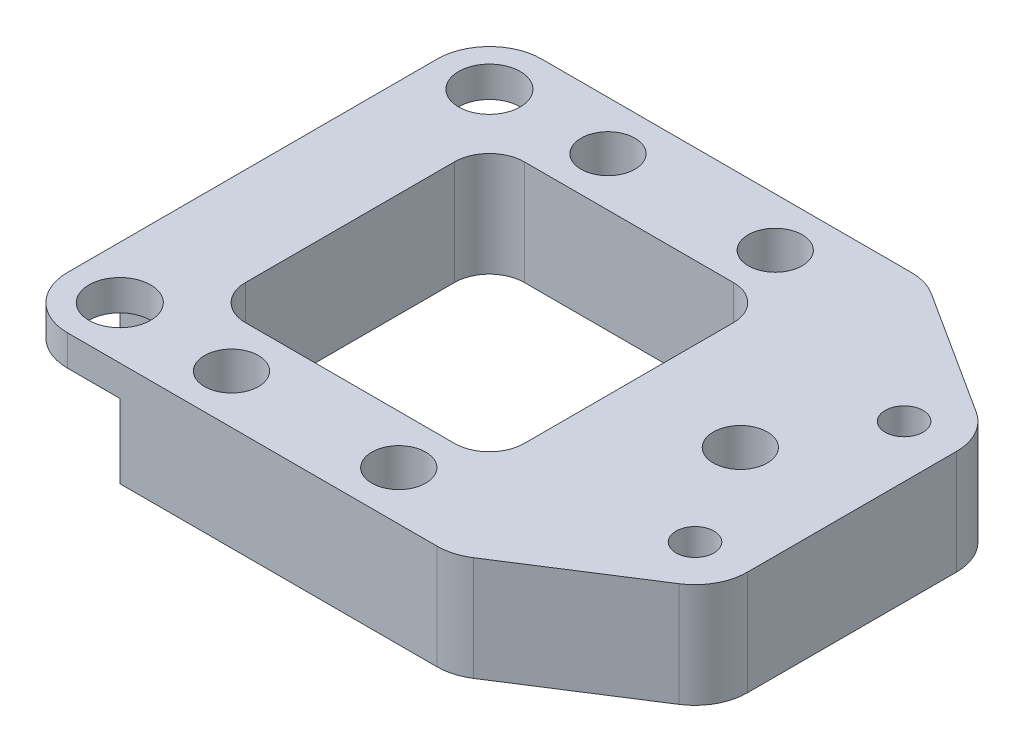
from build123d import *

# Parameters (mm, degrees)
BOSS_EXTRUDE3_DEPTH                             = 9.525
CBORE_FOR_10_SOCKET_HEAD_CAP_SCREW1_D           = 5.6134
CBORE_FOR_10_SOCKET_HEAD_CAP_SCREW1_CBORE_D     = 9.525
CBORE_FOR_10_SOCKET_HEAD_CAP_SCREW1_CBORE_DEPTH = 6.731
CUT_EXTRUDE1_DEPTH                              = 6.731
CUT_EXTRUDE2_DEPTH                              = 41.592150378
F_10_0_1935_DIAMETER_HOLE1_D                    = 4.9149
F_8_32_TAPPED_HOLE1_D                           = 3.4544


with BuildPart() as part:
    # Sketch12 → Boss-Extrude3 (new body)
    with BuildSketch(Plane(origin=(0, 0, 0), x_dir=(1, 0, 0), z_dir=(0, 1, 0))):
        with BuildLine():
            Line((16.8402, 21.6027), (-16.8402, 21.6027))
            ThreePointArc((-16.8402, 21.6027), (-20.207796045, 20.207796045), (-21.6027, 16.8402))
            Line((-21.6027, 16.8402), (-21.6027, -16.8402))
            ThreePointArc((-21.6027, -16.8402), (-20.207796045, -20.207796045), (-16.8402, -21.6027))
            Line((-16.8402, -21.6027), (16.8402, -21.6027))
            ThreePointArc((16.8402, -21.6027), (18.178796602, -21.410710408), (19.409468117, -20.850220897))
            Line((19.409468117, -20.850220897), (30.826768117, -13.535020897))
            ThreePointArc((30.826768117, -13.535020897), (32.435869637, -11.810308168), (33.02, -9.525))
            Line((33.02, -9.525), (33.02, 9.525))
            ThreePointArc((33.02, 9.525), (32.435869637, 11.810308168), (30.826768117, 13.535020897))
            Line((30.826768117, 13.535020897), (19.409468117, 20.850220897))
            ThreePointArc((19.409468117, 20.850220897), (18.178796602, 21.410710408), (16.8402, 21.6027))
        make_face()
    extrude(amount=BOSS_EXTRUDE3_DEPTH)

    # CBORE for _10 Socket Head Cap Screw1 (through all)
    with Locations(Plane(origin=(0, 0, 0), x_dir=(-1, 0, 0), z_dir=(0, -1, 0))):
        with Locations((16.8402, 16.8402), (16.8402, -16.8402)):
            CounterBoreHole(CBORE_FOR_10_SOCKET_HEAD_CAP_SCREW1_D / 2, CBORE_FOR_10_SOCKET_HEAD_CAP_SCREW1_CBORE_D / 2, CBORE_FOR_10_SOCKET_HEAD_CAP_SCREW1_CBORE_DEPTH)

    # Sketch19 → Cut-Extrude1 (cut)
    with BuildSketch(Plane.XZ):
        with BuildLine():
            Line((-16.8402, 12.0777), (-21.6027, 12.0777))
            Line((-21.6027, 12.0777), (-21.6027, 16.8402))
            ThreePointArc((-21.6027, 16.8402), (-20.207796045, 20.207796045), (-16.8402, 21.6027))
            Line((-16.8402, 21.6027), (-12.0777, 21.6027))
            Line((-12.0777, 21.6027), (-12.0777, 16.8402))
            ThreePointArc((-12.0777, 16.8402), (-13.472603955, 13.472603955), (-16.8402, 12.0777))
        make_face()
        with BuildLine():
            Line((-16.8402, -12.0777), (-21.6027, -12.0777))
            Line((-21.6027, -12.0777), (-21.6027, -16.8402))
            ThreePointArc((-21.6027, -16.8402), (-20.207796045, -20.207796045), (-16.8402, -21.6027))
            Line((-16.8402, -21.6027), (-12.0777, -21.6027))
            Line((-12.0777, -21.6027), (-12.0777, -16.8402))
            ThreePointArc((-12.0777, -16.8402), (-13.472603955, -13.472603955), (-16.8402, -12.0777))
        make_face()
    extrude(amount=-CUT_EXTRUDE1_DEPTH, mode=Mode.SUBTRACT)

    # Sketch20 → Cut-Extrude2 (cut, through all)
    with BuildSketch(Plane.XZ):
        with BuildLine():
            Line((12.7, -9.525), (12.7, 9.525))
            ThreePointArc((12.7, 9.525), (11.77006403, 11.77006403), (9.525, 12.7))
            Line((9.525, 12.7), (-9.525, 12.7))
            ThreePointArc((-9.525, 12.7), (-11.77006403, 11.77006403), (-12.7, 9.525))
            Line((-12.7, 9.525), (-12.7, -9.525))
            ThreePointArc((-12.7, -9.525), (-11.77006403, -11.77006403), (-9.525, -12.7))
            Line((-9.525, -12.7), (9.525, -12.7))
            ThreePointArc((9.525, -12.7), (11.77006403, -11.77006403), (12.7, -9.525))
        make_face()
    extrude(amount=-CUT_EXTRUDE2_DEPTH, mode=Mode.SUBTRACT)

    # 10 _0.1935_ Diameter Hole1 (through all)
    with Locations(Plane(origin=(0, 0, 0), x_dir=(-1, 0, 0), z_dir=(0, -1, 0))):
        with Locations((-8.89, -17.15135), (-8.89, 17.15135), (-22.86, 0), (6.35, 17.15135), (6.35, -17.15135)):
            Hole(F_10_0_1935_DIAMETER_HOLE1_D / 2)

    # 8-32 Tapped Hole1 (through all)
    with Locations(Plane(origin=(0, 0, 0), x_dir=(-1, 0, 0), z_dir=(0, -1, 0))):
        with Locations((-28.2575, -9.525), (-28.2575, 9.525)):
            Hole(F_8_32_TAPPED_HOLE1_D / 2)


solid = part.part
